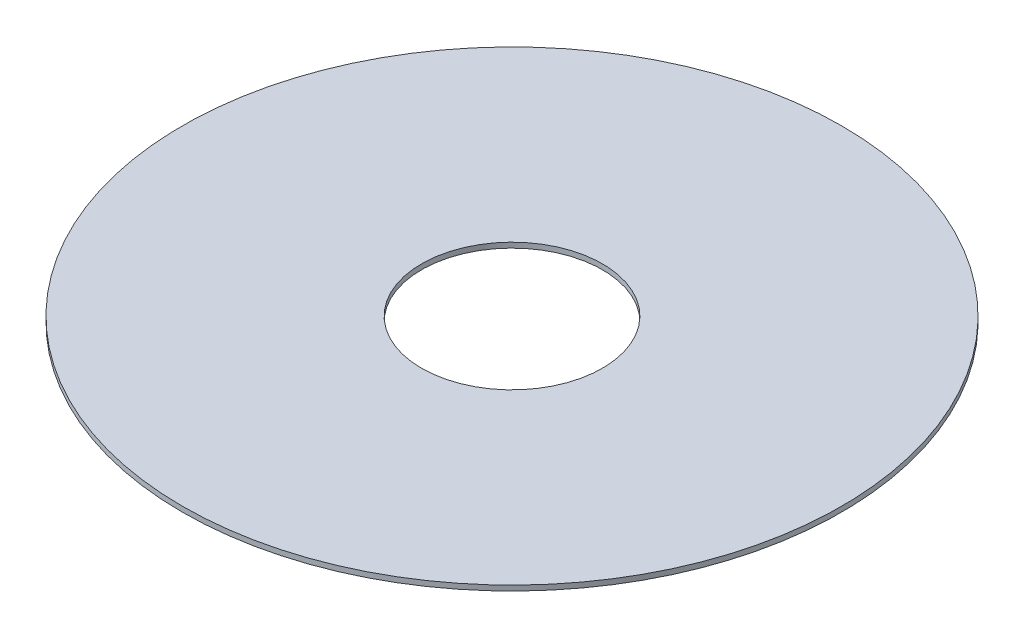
from build123d import *

# Parameters (mm, degrees)
AUFSATZ_LINEAR_AUSTRAGEN1_DEPTH      = 0.1
AUFSATZ_LINEAR_AUSTRAGEN1_DEPTH_BACK = 0.1
SKIZZE1_R                            = 12.75
SKIZZE1_R_2                          = 3.5


with BuildPart() as part:
    # Skizze1 → Aufsatz-Linear austragen1 (new, two sides: drawn at the far end of the back side and taken through both)
    with BuildSketch(Plane(origin=(0, 0, 0), x_dir=(1, 0, 0), z_dir=(0, 1, 0)).offset(-AUFSATZ_LINEAR_AUSTRAGEN1_DEPTH_BACK)):
        with Locations(Location((0, 0, 0), (0, 0, 270))):
            Circle(SKIZZE1_R)
        with Locations(Location((0, 0, 0), (0, 0, 270))):
            Circle(SKIZZE1_R_2, mode=Mode.SUBTRACT)
    extrude(amount=AUFSATZ_LINEAR_AUSTRAGEN1_DEPTH + AUFSATZ_LINEAR_AUSTRAGEN1_DEPTH_BACK)


solid = part.part
